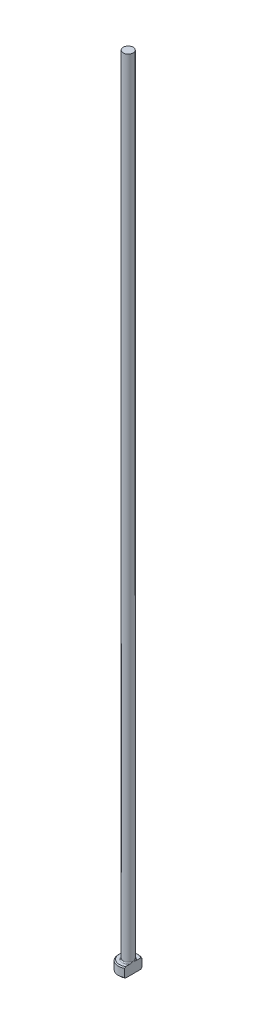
from build123d import *
from build123d.topology import SkipClean

# Parameters (mm, degrees)
CHAMFER1_SIZE = 0.2
FILLET1_R     = 0.2
KEY_DEPTH     = 161.024998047


with BuildPart() as part:
    # Sketch1 → Revolve1 (revolve)
    with BuildSketch(Plane.XY, mode=Mode.PRIVATE) as revolve1_sk:
        Polygon((0, 0), (-2, 0), (-2, 2), (-1, 2), (-1, 160), (0, 160), align=None)
    revolve(revolve1_sk.sketch.rotate(Axis((0, 259.958771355, 0), (0, -1, 0)), 270), axis=Axis((0, 259.958771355, 0), (0, -1, 0)))

    # Chamfer1
    chamfer1_edges = [part.edges().sort_by_distance(p)[0] for p in [
        (0, 2, -2),
        (0, 0, -2),
    ]]
    chamfer(chamfer1_edges, length=CHAMFER1_SIZE)

    # Fillet1
    fillet1_edges = [part.edges().sort_by_distance(p)[0] for p in [
        (0, 2, -1),
    ]]
    fillet(fillet1_edges, radius=FILLET1_R)

    # Sketch2 → KEY (cut, through all)
    with SkipClean():  # the faces are left unmerged after this step: merging them gives an invalid solid
        with BuildSketch(Plane(origin=(0, 0, 0), x_dir=(1, 0, 0), z_dir=(0, 1, 0))):
            with BuildLine():
                Line((1, 1.732050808), (1, -1.732050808))
                ThreePointArc((1, -1.732050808), (2, 0), (1, 1.732050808))
            make_face()
        extrude(amount=KEY_DEPTH, mode=Mode.SUBTRACT)


solid = part.part
